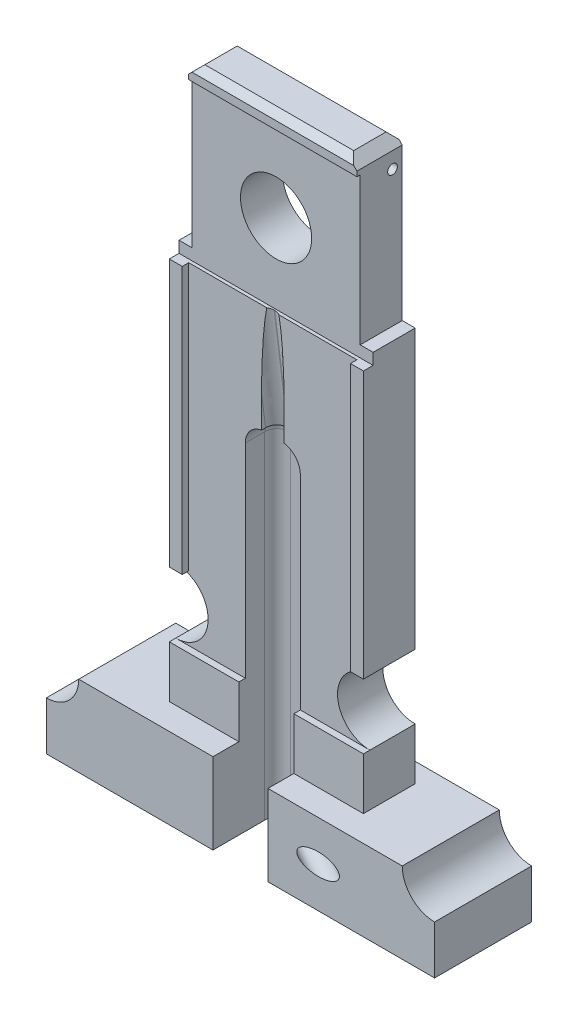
from build123d import *

# Parameters (mm, degrees)
SKIZZE1_W                        = 60
SKIZZE1_H                        = 12.5
AUFSATZ_LINEAR_AUSTRAGEN1_DEPTH  = 15
SKIZZE2_R                        = 5
SCHNITT_LINEAR_AUSTRAGEN1_DEPTH  = 35.11836016
SKIZZE3_W                        = 30
SKIZZE3_H                        = 86
AUFSATZ_LINEAR_AUSTRAGEN2_DEPTH  = 15
SKIZZE4_W                        = 89.121125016
SKIZZE4_H                        = 102.065336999
SCHNITT_LINEAR_AUSTRAGEN2_DEPTH  = 4
SKIZZE5_W                        = 44.337843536
SKIZZE5_H                        = 87.033544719
SCHNITT_LINEAR_AUSTRAGEN3_DEPTH  = 3
SKIZZE6_R                        = 5
SCHNITT_LINEAR_AUSTRAGEN4_DEPTH  = 98.627160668
SKIZZE7_W                        = 26
SKIZZE7_H                        = 80
SCHNITT_LINEAR_AUSTRAGEN5_DEPTH  = 1
SKIZZE9_W                        = 48.312880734
SKIZZE9_H                        = 24.5
SCHNITT_LINEAR_AUSTRAGEN7_DEPTH  = 1.5
SKIZZE10_R                       = 5.5
SCHNITT_LINEAR_AUSTRAGEN8_DEPTH  = 98.469546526
SKIZZE11_W                       = 22.801873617
SKIZZE11_H                       = 26.414051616
SCHNITT_LINEAR_AUSTRAGEN9_DEPTH  = 2
SKIZZE12_W                       = 19.866978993
SKIZZE12_H                       = 28.220140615
SCHNITT_LINEAR_AUSTRAGEN10_DEPTH = 2
SCHNITT_LINEAR_AUSTRAGEN11_DEPTH = 10
SKIZZE16_W                       = 34.819977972
SKIZZE16_H                       = 10
SCHNITT_LINEAR_AUSTRAGEN12_DEPTH = 1
VERRUNDUNG4_R                    = 2
SKIZZE22_R                       = 1.65
SCHNITT_LINEAR_AUSTRAGEN14_DEPTH = 12.5
FASE1_SIZE                       = 1.5
FASE2_SIZE                       = 1
SKIZZE23_R                       = 0.75
SCHNITT_LINEAR_AUSTRAGEN15_DEPTH = 5
SCHNITT_LINEAR_START             = -5
SKIZZE24_R                       = 0.75
SCHNITT_LINEAR_AUSTRAGEN16_DEPTH = 5


with BuildPart() as part:
    # Skizze1 → Aufsatz-Linear austragen1 (new body)
    with BuildSketch(Plane.XY):
        Rectangle(SKIZZE1_W, SKIZZE1_H)
    extrude(amount=-AUFSATZ_LINEAR_AUSTRAGEN1_DEPTH)

    # Skizze2 → Schnitt-Linear austragen1 (cut, through all)
    with BuildSketch(Plane.XY):
        with Locations((30, 6.25)):
            Circle(SKIZZE2_R)
        with Locations((-30, 6.25)):
            Circle(SKIZZE2_R)
    extrude(amount=-SCHNITT_LINEAR_AUSTRAGEN1_DEPTH, mode=Mode.SUBTRACT)

    # Skizze3 → Aufsatz-Linear austragen2 (add, through all)
    with BuildSketch(Plane.XY):
        with Locations((0, 49.25)):
            Rectangle(SKIZZE3_W, SKIZZE3_H)
    extrude(amount=-AUFSATZ_LINEAR_AUSTRAGEN2_DEPTH)

    # Skizze4 → Schnitt-Linear austragen2 (cut)
    with BuildSketch(Plane.XY):
        with Locations((0, 57.2826685)):
            Rectangle(SKIZZE4_W, SKIZZE4_H)
    extrude(amount=-SCHNITT_LINEAR_AUSTRAGEN2_DEPTH, mode=Mode.SUBTRACT)

    # Skizze5 → Schnitt-Linear austragen3 (cut)
    with BuildSketch(Plane(origin=(0, 0, -15), x_dir=(-1, 0, 0), z_dir=(0, 0, -1))):
        with Locations((0, 49.76677236)):
            Rectangle(SKIZZE5_W, SKIZZE5_H)
    extrude(amount=-SCHNITT_LINEAR_AUSTRAGEN3_DEPTH, mode=Mode.SUBTRACT)

    # Skizze6 → Schnitt-Linear austragen4 (cut, through all)
    with BuildSketch(Plane.XY.offset(-4)):
        with Locations((-15, 19.25)):
            Circle(SKIZZE6_R)
        with Locations((15, 19.25)):
            Circle(SKIZZE6_R)
    extrude(amount=-SCHNITT_LINEAR_AUSTRAGEN4_DEPTH, mode=Mode.SUBTRACT)

    # Skizze7 → Schnitt-Linear austragen5 (cut)
    with BuildSketch(Plane.XY.offset(-4)):
        with Locations((0, 54.25)):
            Rectangle(SKIZZE7_W, SKIZZE7_H)
    extrude(amount=-SCHNITT_LINEAR_AUSTRAGEN5_DEPTH, mode=Mode.SUBTRACT)

    # Skizze9 → Schnitt-Linear austragen7 (cut)
    with BuildSketch(Plane.XY.offset(-4)):
        with Locations((0, 77.75)):
            Rectangle(SKIZZE9_W, SKIZZE9_H)
    extrude(amount=-SCHNITT_LINEAR_AUSTRAGEN7_DEPTH, mode=Mode.SUBTRACT)

    # Skizze10 → Schnitt-Linear austragen8 (cut, through all)
    with BuildSketch(Plane.XY.offset(-5.5)):
        with Locations((0, 77.75)):
            Circle(SKIZZE10_R)
    extrude(amount=-SCHNITT_LINEAR_AUSTRAGEN8_DEPTH, mode=Mode.SUBTRACT)

    # Skizze11 → Schnitt-Linear austragen9 (cut)
    with BuildSketch(Plane.ZY.offset(15)):
        with Locations((-8.538680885, 80.457025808)):
            Rectangle(SKIZZE11_W, SKIZZE11_H)
    extrude(amount=-SCHNITT_LINEAR_AUSTRAGEN9_DEPTH, mode=Mode.SUBTRACT)

    # Skizze12 → Schnitt-Linear austragen10 (cut)
    with BuildSketch(Plane(origin=(15, 0, 0), x_dir=(0, 0, -1), z_dir=(1, 0, 0))):
        with Locations((8.064402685, 81.360070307)):
            Rectangle(SKIZZE12_W, SKIZZE12_H)
    extrude(amount=-SCHNITT_LINEAR_AUSTRAGEN10_DEPTH, mode=Mode.SUBTRACT)

    # Skizze14 → Schnitt-Linear austragen11 (cut)
    with BuildSketch(Plane.XY):
        with BuildLine():
            Line((-4.25, -26.912537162), (4.25, -26.912537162))
            Line((4.25, -26.912537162), (4.25, 45.75))
            ThreePointArc((4.25, 45.75), (3.371320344, 47.871320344), (1.25, 48.75))
            Line((1.25, 48.75), (-1.25, 48.75))
            ThreePointArc((-1.25, 48.75), (-3.371320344, 47.871320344), (-4.25, 45.75))
            Line((-4.25, 45.75), (-4.25, -26.912537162))
        make_face()
    extrude(amount=-SCHNITT_LINEAR_AUSTRAGEN11_DEPTH, mode=Mode.SUBTRACT)

    # Skizze16 → Schnitt-Linear austragen12 (cut)
    with BuildSketch(Plane.XY.offset(-4)):
        with Locations((0.132540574, 19.25)):
            Rectangle(SKIZZE16_W, SKIZZE16_H)
    extrude(amount=-SCHNITT_LINEAR_AUSTRAGEN12_DEPTH, mode=Mode.SUBTRACT)

    # Schnitt-Austragung2: sweep along a path in Skizze18
    with BuildLine(Plane(origin=(0, 0, 0), x_dir=(0, 0, -1), z_dir=(1, 0, 0))) as schnitt_austragung2_path:
        Line((7.5, 47.75), (4.915883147, 68.625031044))
    # Skizze19 → Schnitt-Austragung2 (sweep, cut)
    with BuildSketch(Plane(origin=(0, 47.75, 0), x_dir=(1, 0, 0), z_dir=(0, 1, 0))):
        with BuildLine():
            Line((-1.75, 2.914201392), (1.75, 2.914201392))
            Line((1.75, 2.914201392), (1.75, 5.746241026))
            ThreePointArc((1.75, 5.746241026), (1.252081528, 6.948322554), (0.05, 7.446241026))
            Line((0.05, 7.446241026), (-0.05, 7.446241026))
            ThreePointArc((-0.05, 7.446241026), (-1.252081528, 6.948322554), (-1.75, 5.746241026))
            Line((-1.75, 5.746241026), (-1.75, 2.914201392))
        make_face()
    sweep(path=schnitt_austragung2_path.line, mode=Mode.SUBTRACT)

    # Verrundung4
    verrundung4_edges = [part.edges().sort_by_distance(p)[0] for p in [
        (-3.371320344, 47.871320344, -10),
        (0, 48.75, -10),
        (3.371320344, 47.871320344, -10),
        (-4.25, 19.75, -10),
        (4.25, 19.75, -10),
    ]]
    fillet(verrundung4_edges, radius=VERRUNDUNG4_R)

    # Skizze22 → Schnitt-Linear austragen14 (cut, symmetric)
    with BuildSketch(Plane(origin=(9, 0, 5.196152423), x_dir=(-0.49999999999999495, 0, 0.8660254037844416), z_dir=(-0.8660254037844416, 0, -0.49999999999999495))):
        with Locations((-6, 0)):
            Circle(SKIZZE22_R)
    extrude(amount=SCHNITT_LINEAR_AUSTRAGEN14_DEPTH, both=True, mode=Mode.SUBTRACT)

    # Fase1
    fase1_edges = [part.edges().sort_by_distance(p)[0] for p in [
        (-13, 92.25, -8.5),
        (13, 92.25, -8.5),
    ]]
    chamfer(fase1_edges, length=FASE1_SIZE)

    # Fase2
    fase2_edges = [part.edges().sort_by_distance(p)[0] for p in [
        (0, 92.25, -5),
        (0, 92.25, -12),
    ]]
    chamfer(fase2_edges, length=FASE2_SIZE)

    # Skizze23 → Schnitt-Linear austragen15 (cut)
    with BuildSketch(Plane.ZY.offset(13)):
        with Locations((-10.5, 88.25)):
            Circle(SKIZZE23_R)
    extrude(amount=-SCHNITT_LINEAR_AUSTRAGEN15_DEPTH, mode=Mode.SUBTRACT)

    # Skizze24 → Schnitt-Linear austragen16 (cut)
    with BuildSketch(Plane(origin=(13, 0, 0), x_dir=(0, 0, -1), z_dir=(1, 0, 0)).offset(SCHNITT_LINEAR_START)):
        with Locations(Location((10.5, 88.25, 0), (0, 0, 180))):
            Circle(SKIZZE24_R)
    extrude(amount=SCHNITT_LINEAR_AUSTRAGEN16_DEPTH, mode=Mode.SUBTRACT)


solid = part.part
